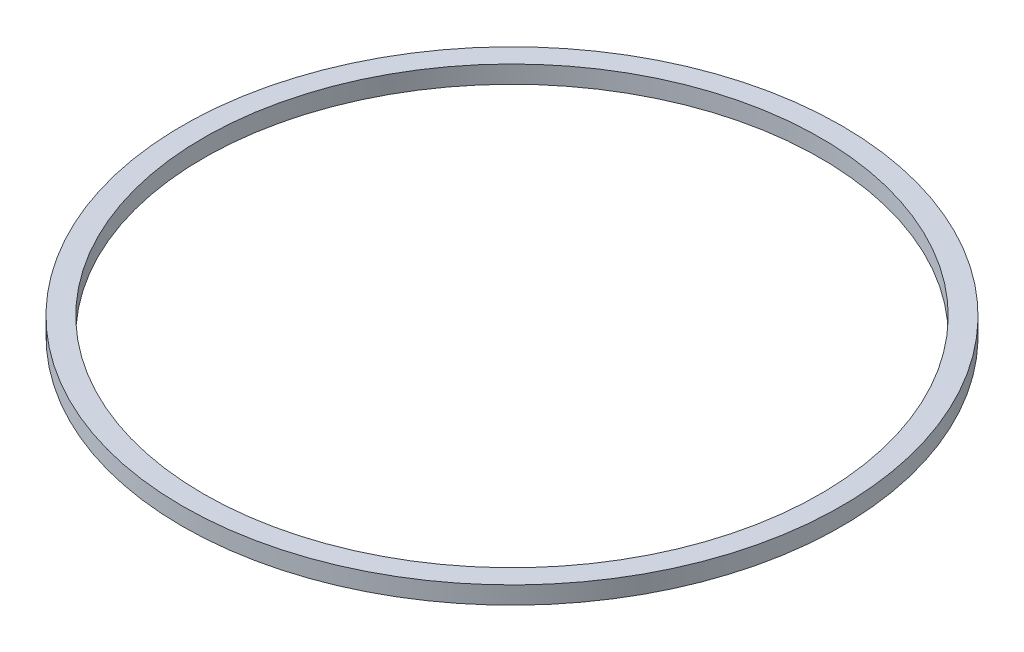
ISO-10303-21;
HEADER;
FILE_DESCRIPTION(('STEP AP214'),'2;1');
FILE_NAME('part.step','',(''),(''),'','','');
FILE_SCHEMA(('AUTOMOTIVE_DESIGN { 1 0 10303 214 1 1 1 1 }'));
ENDSEC;
DATA;
#1=APPLICATION_CONTEXT('core data for automotive mechanical design processes');
#2=APPLICATION_PROTOCOL_DEFINITION('international standard','automotive_design',2000,#1);
#3=PRODUCT_CONTEXT('',#1,'mechanical');
#4=PRODUCT('Part','Part','',(#3));
#5=PRODUCT_RELATED_PRODUCT_CATEGORY('part','',(#4));
#6=PRODUCT_DEFINITION_FORMATION('','',#4);
#7=PRODUCT_DEFINITION_CONTEXT('part definition',#1,'design');
#8=PRODUCT_DEFINITION('design','',#6,#7);
#9=PRODUCT_DEFINITION_SHAPE('','',#8);
#10=(LENGTH_UNIT() NAMED_UNIT(*) SI_UNIT(.MILLI.,.METRE.));
#11=(NAMED_UNIT(*) PLANE_ANGLE_UNIT() SI_UNIT($,.RADIAN.));
#12=(NAMED_UNIT(*) SI_UNIT($,.STERADIAN.) SOLID_ANGLE_UNIT());
#13=UNCERTAINTY_MEASURE_WITH_UNIT(LENGTH_MEASURE(1.E-05),#10,'distance_accuracy_value','');
#14=(GEOMETRIC_REPRESENTATION_CONTEXT(3) GLOBAL_UNCERTAINTY_ASSIGNED_CONTEXT((#13)) GLOBAL_UNIT_ASSIGNED_CONTEXT((#10,
#11,#12)) REPRESENTATION_CONTEXT('',''));
#15=CARTESIAN_POINT('',(0.,0.,0.));
#16=DIRECTION('',(0.,0.,1.));
#17=DIRECTION('',(1.,0.,0.));
#18=AXIS2_PLACEMENT_3D('',#15,#16,#17);
#19=CARTESIAN_POINT('',(0.,1.,0.));
#20=DIRECTION('',(0.,1.,0.));
#21=DIRECTION('',(0.,0.,1.));
#22=AXIS2_PLACEMENT_3D('',#19,#20,#21);
#23=PLANE('',#22);
#24=CARTESIAN_POINT('',(0.,1.,0.));
#25=DIRECTION('',(0.,1.,0.));
#26=DIRECTION('',(0.,0.,1.));
#27=AXIS2_PLACEMENT_3D('',#24,#25,#26);
#28=CIRCLE('',#27,18.759);
#29=CARTESIAN_POINT('',(0.,1.,18.759));
#30=VERTEX_POINT('',#29);
#31=EDGE_CURVE('E10',#30,#30,#28,.T.);
#32=ORIENTED_EDGE('',*,*,#31,.T.);
#33=EDGE_LOOP('',(#32));
#34=FACE_BOUND('',#33,.T.);
#35=CARTESIAN_POINT('',(0.,1.,0.));
#36=DIRECTION('',(0.,1.,0.));
#37=DIRECTION('',(0.,0.,1.));
#38=AXIS2_PLACEMENT_3D('',#35,#36,#37);
#39=CIRCLE('',#38,17.559);
#40=CARTESIAN_POINT('',(0.,1.,17.559));
#41=VERTEX_POINT('',#40);
#42=EDGE_CURVE('E43',#41,#41,#39,.T.);
#43=ORIENTED_EDGE('',*,*,#42,.F.);
#44=EDGE_LOOP('',(#43));
#45=FACE_BOUND('',#44,.T.);
#46=ADVANCED_FACE('F32',(#34,#45),#23,.T.);
#47=CARTESIAN_POINT('',(0.,0.,0.));
#48=DIRECTION('',(0.,1.,0.));
#49=DIRECTION('',(0.,0.,1.));
#50=AXIS2_PLACEMENT_3D('',#47,#48,#49);
#51=PLANE('',#50);
#52=CARTESIAN_POINT('',(0.,0.,0.));
#53=DIRECTION('',(0.,1.,0.));
#54=DIRECTION('',(0.,0.,1.));
#55=AXIS2_PLACEMENT_3D('',#52,#53,#54);
#56=CIRCLE('',#55,18.759);
#57=CARTESIAN_POINT('',(0.,0.,18.759));
#58=VERTEX_POINT('',#57);
#59=EDGE_CURVE('E36',#58,#58,#56,.T.);
#60=ORIENTED_EDGE('',*,*,#59,.F.);
#61=EDGE_LOOP('',(#60));
#62=FACE_BOUND('',#61,.T.);
#63=CARTESIAN_POINT('',(0.,0.,0.));
#64=DIRECTION('',(0.,1.,0.));
#65=DIRECTION('',(0.,0.,1.));
#66=AXIS2_PLACEMENT_3D('',#63,#64,#65);
#67=CIRCLE('',#66,17.559);
#68=CARTESIAN_POINT('',(0.,0.,17.559));
#69=VERTEX_POINT('',#68);
#70=EDGE_CURVE('E45',#69,#69,#67,.T.);
#71=ORIENTED_EDGE('',*,*,#70,.T.);
#72=EDGE_LOOP('',(#71));
#73=FACE_BOUND('',#72,.T.);
#74=ADVANCED_FACE('F55',(#62,#73),#51,.F.);
#75=CARTESIAN_POINT('',(0.,1.,0.));
#76=DIRECTION('',(0.,-1.,0.));
#77=DIRECTION('',(0.,0.,-1.));
#78=AXIS2_PLACEMENT_3D('',#75,#76,#77);
#79=CYLINDRICAL_SURFACE('',#78,18.759);
#80=ORIENTED_EDGE('',*,*,#31,.F.);
#81=EDGE_LOOP('',(#80));
#82=FACE_BOUND('',#81,.T.);
#83=ORIENTED_EDGE('',*,*,#59,.T.);
#84=EDGE_LOOP('',(#83));
#85=FACE_BOUND('',#84,.T.);
#86=ADVANCED_FACE('F34',(#82,#85),#79,.T.);
#87=CARTESIAN_POINT('',(0.,1.,0.));
#88=DIRECTION('',(0.,-1.,0.));
#89=DIRECTION('',(0.,0.,-1.));
#90=AXIS2_PLACEMENT_3D('',#87,#88,#89);
#91=CYLINDRICAL_SURFACE('',#90,17.559);
#92=ORIENTED_EDGE('',*,*,#42,.T.);
#93=EDGE_LOOP('',(#92));
#94=FACE_BOUND('',#93,.T.);
#95=ORIENTED_EDGE('',*,*,#70,.F.);
#96=EDGE_LOOP('',(#95));
#97=FACE_BOUND('',#96,.T.);
#98=ADVANCED_FACE('F51',(#94,#97),#91,.F.);
#99=CLOSED_SHELL('',(#46,#74,#86,#98));
#100=MANIFOLD_SOLID_BREP('B2',#99);
#101=ADVANCED_BREP_SHAPE_REPRESENTATION('',(#18,#100),#14);
#102=SHAPE_DEFINITION_REPRESENTATION(#9,#101);
ENDSEC;
END-ISO-10303-21;
